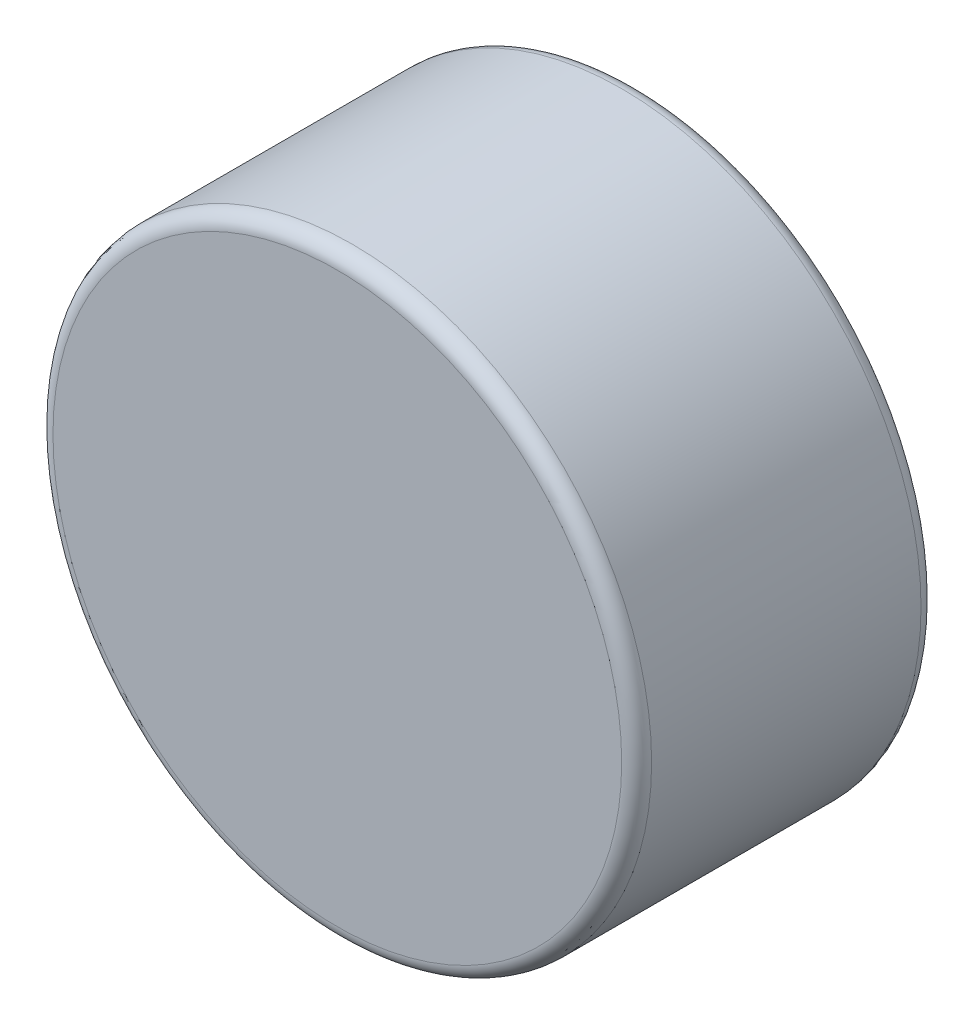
from build123d import *

# Parameters (mm, degrees)
SKETCH_1_R      = 10
EXTRUDE_1_DEPTH = 5
FILLET_1_R      = 0.5


with BuildPart() as part:
    # Sketch 1 → Extrude 1 (new, symmetric)
    with BuildSketch(Plane.XY):
        Circle(SKETCH_1_R)
    extrude(amount=EXTRUDE_1_DEPTH, both=True)

    # Fillet 1
    fillet_1_edges = [part.edges().sort_by_distance(p)[0] for p in [
        (-10, 0, -5),
        (-10, 0, 5),
    ]]
    fillet(fillet_1_edges, radius=FILLET_1_R)


solid = part.part
